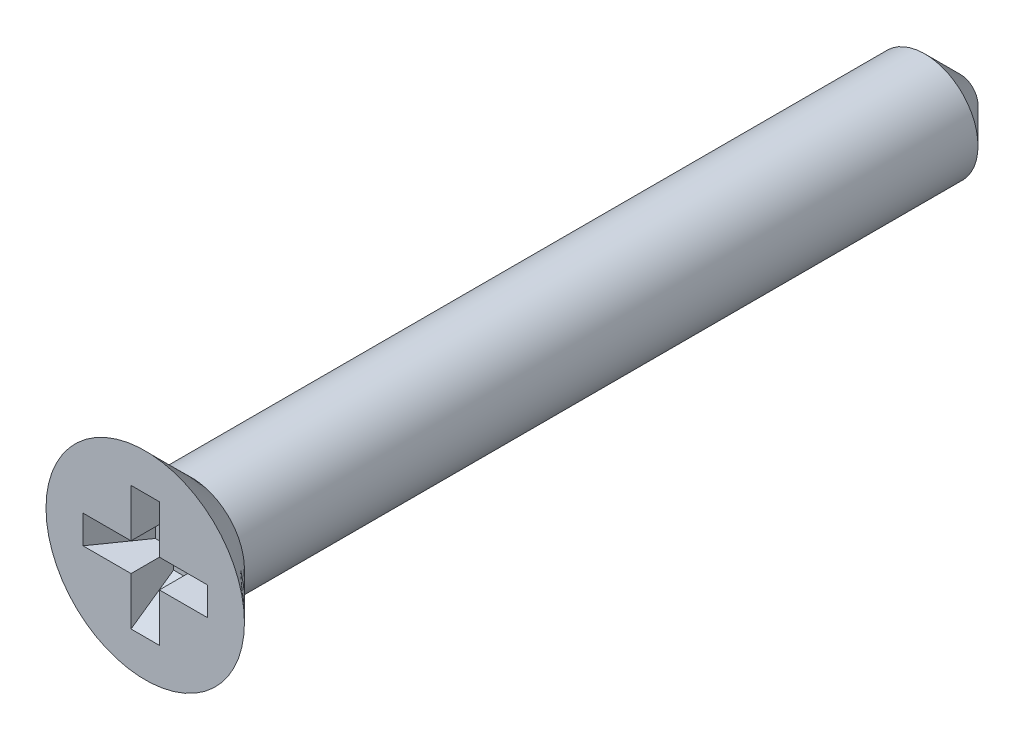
ISO-10303-21;
HEADER;
FILE_DESCRIPTION(('STEP AP214'),'2;1');
FILE_NAME('part.step','',(''),(''),'','','');
FILE_SCHEMA(('AUTOMOTIVE_DESIGN { 1 0 10303 214 1 1 1 1 }'));
ENDSEC;
DATA;
#1=APPLICATION_CONTEXT('core data for automotive mechanical design processes');
#2=APPLICATION_PROTOCOL_DEFINITION('international standard','automotive_design',2000,#1);
#3=PRODUCT_CONTEXT('',#1,'mechanical');
#4=PRODUCT('Part','Part','',(#3));
#5=PRODUCT_RELATED_PRODUCT_CATEGORY('part','',(#4));
#6=PRODUCT_DEFINITION_FORMATION('','',#4);
#7=PRODUCT_DEFINITION_CONTEXT('part definition',#1,'design');
#8=PRODUCT_DEFINITION('design','',#6,#7);
#9=PRODUCT_DEFINITION_SHAPE('','',#8);
#10=(LENGTH_UNIT() NAMED_UNIT(*) SI_UNIT(.MILLI.,.METRE.));
#11=(NAMED_UNIT(*) PLANE_ANGLE_UNIT() SI_UNIT($,.RADIAN.));
#12=(NAMED_UNIT(*) SI_UNIT($,.STERADIAN.) SOLID_ANGLE_UNIT());
#13=UNCERTAINTY_MEASURE_WITH_UNIT(LENGTH_MEASURE(1.E-05),#10,'distance_accuracy_value','');
#14=(GEOMETRIC_REPRESENTATION_CONTEXT(3) GLOBAL_UNCERTAINTY_ASSIGNED_CONTEXT((#13)) GLOBAL_UNIT_ASSIGNED_CONTEXT((#10,
#11,#12)) REPRESENTATION_CONTEXT('',''));
#15=CARTESIAN_POINT('',(0.,0.,0.));
#16=DIRECTION('',(0.,0.,1.));
#17=DIRECTION('',(1.,0.,0.));
#18=AXIS2_PLACEMENT_3D('',#15,#16,#17);
#19=CARTESIAN_POINT('',(-1.75499287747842,-0.4,0.));
#20=DIRECTION('',(0.819152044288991,0.,0.573576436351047));
#21=DIRECTION('',(0.573576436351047,0.,-0.819152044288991));
#22=AXIS2_PLACEMENT_3D('',#19,#20,#21);
#23=PLANE('',#22);
#24=DIRECTION('',(0.,1.,0.));
#25=VECTOR('',#24,1.);
#26=CARTESIAN_POINT('',(0.,0.4,-2.50638957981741));
#27=LINE('',#26,#25);
#28=CARTESIAN_POINT('',(0.,-0.29361042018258,-2.50638957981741));
#29=VERTEX_POINT('',#28);
#30=CARTESIAN_POINT('',(0.,0.,-2.50638957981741));
#31=VERTEX_POINT('',#30);
#32=EDGE_CURVE('E354',#29,#31,#27,.T.);
#33=ORIENTED_EDGE('',*,*,#32,.F.);
#34=CARTESIAN_POINT('',(0.103438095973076,-0.102874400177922,-2.65411449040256));
#35=CARTESIAN_POINT('',(0.09992365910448,-0.113485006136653,-2.64909535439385));
#36=CARTESIAN_POINT('',(0.096077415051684,-0.123726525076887,-2.64360234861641));
#37=CARTESIAN_POINT('',(0.0878958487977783,-0.143557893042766,-2.63191786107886));
#38=CARTESIAN_POINT('',(0.0835619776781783,-0.153149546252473,-2.62572845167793));
#39=CARTESIAN_POINT('',(0.0745900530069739,-0.171760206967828,-2.61291521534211));
#40=CARTESIAN_POINT('',(0.0699544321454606,-0.180782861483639,-2.60629486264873));
#41=CARTESIAN_POINT('',(0.0604348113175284,-0.198432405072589,-2.59269943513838));
#42=CARTESIAN_POINT('',(0.0555506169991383,-0.207058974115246,-2.58572408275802));
#43=CARTESIAN_POINT('',(0.0425194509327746,-0.229237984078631,-2.56711364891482));
#44=CARTESIAN_POINT('',(0.0342270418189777,-0.242528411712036,-2.55527086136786));
#45=CARTESIAN_POINT('',(0.0172728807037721,-0.268554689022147,-2.5310578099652));
#46=CARTESIAN_POINT('',(0.00860925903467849,-0.28128685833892,-2.51868487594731));
#47=CARTESIAN_POINT('',(-0.000140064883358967,-0.2938104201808,-2.50618954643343));
#48=B_SPLINE_CURVE_WITH_KNOTS('',3,(#34,#35,#36,#37,#38,#39,#40,#41,#42,#43,#44,#45,#46,#47),
.UNSPECIFIED.,.F.,.F.,(4,2,2,2,2,2,4),(0.,0.036695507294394,0.0732845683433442,
0.109608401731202,0.145961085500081,0.204852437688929,0.264086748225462),.UNSPECIFIED.);
#49=CARTESIAN_POINT('',(0.103298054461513,-0.103298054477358,-2.65391449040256));
#50=VERTEX_POINT('',#49);
#51=EDGE_CURVE('E289',#50,#29,#48,.T.);
#52=ORIENTED_EDGE('',*,*,#51,.F.);
#53=DIRECTION('',(-0.497542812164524,0.497542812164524,0.710564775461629));
#54=VECTOR('',#53,1.);
#55=CARTESIAN_POINT('',(-1.41956594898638,1.41956594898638,-0.479039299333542));
#56=LINE('',#55,#54);
#57=EDGE_CURVE('E352',#50,#31,#56,.T.);
#58=ORIENTED_EDGE('',*,*,#57,.T.);
#59=EDGE_LOOP('',(#33,#52,#58));
#60=FACE_BOUND('',#59,.T.);
#61=ADVANCED_FACE('F27',(#60),#23,.T.);
#62=DIRECTION('',(0.,1.,0.));
#63=VECTOR('',#62,1.);
#64=CARTESIAN_POINT('',(-0.91474383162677,-0.4,-1.2));
#65=LINE('',#64,#63);
#66=CARTESIAN_POINT('',(-0.91474383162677,0.4,-1.2));
#67=VERTEX_POINT('',#66);
#68=CARTESIAN_POINT('',(-0.91474383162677,-0.4,-1.2));
#69=VERTEX_POINT('',#68);
#70=EDGE_CURVE('E348',#67,#69,#65,.F.);
#71=ORIENTED_EDGE('',*,*,#70,.F.);
#72=DIRECTION('',(0.573576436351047,0.,-0.819152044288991));
#73=VECTOR('',#72,1.);
#74=CARTESIAN_POINT('',(-1.19117730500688,0.4,-0.8052120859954));
#75=LINE('',#74,#73);
#76=CARTESIAN_POINT('',(-1.75499287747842,0.4,0.));
#77=VERTEX_POINT('',#76);
#78=EDGE_CURVE('E232',#67,#77,#75,.F.);
#79=ORIENTED_EDGE('',*,*,#78,.T.);
#80=DIRECTION('',(0.,-1.,0.));
#81=VECTOR('',#80,1.);
#82=CARTESIAN_POINT('',(-1.75499287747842,-0.4,0.));
#83=LINE('',#82,#81);
#84=CARTESIAN_POINT('',(-1.75499287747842,-0.4,0.));
#85=VERTEX_POINT('',#84);
#86=EDGE_CURVE('E173',#77,#85,#83,.T.);
#87=ORIENTED_EDGE('',*,*,#86,.T.);
#88=DIRECTION('',(0.573576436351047,0.,-0.819152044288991));
#89=VECTOR('',#88,1.);
#90=CARTESIAN_POINT('',(-1.75499287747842,-0.4,0.));
#91=LINE('',#90,#89);
#92=EDGE_CURVE('E164',#69,#85,#91,.F.);
#93=ORIENTED_EDGE('',*,*,#92,.F.);
#94=EDGE_LOOP('',(#71,#79,#87,#93));
#95=FACE_BOUND('',#94,.T.);
#96=ADVANCED_FACE('F283',(#95),#23,.T.);
#97=CARTESIAN_POINT('',(0.4,-1.75499287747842,0.));
#98=DIRECTION('',(0.,0.819152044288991,0.573576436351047));
#99=DIRECTION('',(0.,-0.573576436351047,0.819152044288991));
#100=AXIS2_PLACEMENT_3D('',#97,#98,#99);
#101=PLANE('',#100);
#102=DIRECTION('',(-1.,0.,0.));
#103=VECTOR('',#102,1.);
#104=CARTESIAN_POINT('',(0.4,-0.91474383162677,-1.2));
#105=LINE('',#104,#103);
#106=CARTESIAN_POINT('',(-0.4,-0.91474383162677,-1.2));
#107=VERTEX_POINT('',#106);
#108=CARTESIAN_POINT('',(0.4,-0.91474383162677,-1.2));
#109=VERTEX_POINT('',#108);
#110=EDGE_CURVE('E346',#107,#109,#105,.F.);
#111=ORIENTED_EDGE('',*,*,#110,.F.);
#112=DIRECTION('',(0.,0.573576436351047,-0.819152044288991));
#113=VECTOR('',#112,1.);
#114=CARTESIAN_POINT('',(-0.4,-0.74539829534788,-1.44185049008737));
#115=LINE('',#114,#113);
#116=CARTESIAN_POINT('',(-0.4,-1.75499287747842,0.));
#117=VERTEX_POINT('',#116);
#118=EDGE_CURVE('E163',#107,#117,#115,.F.);
#119=ORIENTED_EDGE('',*,*,#118,.T.);
#120=DIRECTION('',(1.,0.,0.));
#121=VECTOR('',#120,1.);
#122=CARTESIAN_POINT('',(0.4,-1.75499287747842,0.));
#123=LINE('',#122,#121);
#124=CARTESIAN_POINT('',(0.4,-1.75499287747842,0.));
#125=VERTEX_POINT('',#124);
#126=EDGE_CURVE('E179',#117,#125,#123,.T.);
#127=ORIENTED_EDGE('',*,*,#126,.T.);
#128=DIRECTION('',(0.,0.573576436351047,-0.819152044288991));
#129=VECTOR('',#128,1.);
#130=CARTESIAN_POINT('',(0.4,-1.75499287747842,0.));
#131=LINE('',#130,#129);
#132=EDGE_CURVE('E240',#109,#125,#131,.F.);
#133=ORIENTED_EDGE('',*,*,#132,.F.);
#134=EDGE_LOOP('',(#111,#119,#127,#133));
#135=FACE_BOUND('',#134,.T.);
#136=ADVANCED_FACE('F279',(#135),#101,.T.);
#137=CARTESIAN_POINT('',(-1.75499287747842,1.75499287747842,-1.2));
#138=DIRECTION('',(0.,0.,-1.));
#139=DIRECTION('',(-1.,0.,0.));
#140=AXIS2_PLACEMENT_3D('',#137,#138,#139);
#141=PLANE('',#140);
#142=DIRECTION('',(0.,-1.,0.));
#143=VECTOR('',#142,1.);
#144=CARTESIAN_POINT('',(-0.4,1.75499287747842,-1.2));
#145=LINE('',#144,#143);
#146=CARTESIAN_POINT('',(-0.4,1.54919333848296,-1.2));
#147=VERTEX_POINT('',#146);
#148=CARTESIAN_POINT('',(-0.4,0.91474383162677,-1.2));
#149=VERTEX_POINT('',#148);
#150=EDGE_CURVE('E223',#147,#149,#145,.T.);
#151=ORIENTED_EDGE('',*,*,#150,.T.);
#152=CARTESIAN_POINT('',(-0.4,0.4,-1.2));
#153=VERTEX_POINT('',#152);
#154=EDGE_CURVE('E224',#149,#153,#145,.T.);
#155=ORIENTED_EDGE('',*,*,#154,.T.);
#156=DIRECTION('',(-1.,0.,0.));
#157=VECTOR('',#156,1.);
#158=CARTESIAN_POINT('',(-1.75499287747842,0.4,-1.2));
#159=LINE('',#158,#157);
#160=EDGE_CURVE('E227',#153,#67,#159,.T.);
#161=ORIENTED_EDGE('',*,*,#160,.T.);
#162=ORIENTED_EDGE('',*,*,#70,.T.);
#163=DIRECTION('',(1.,0.,0.));
#164=VECTOR('',#163,1.);
#165=CARTESIAN_POINT('',(-1.75499287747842,-0.4,-1.2));
#166=LINE('',#165,#164);
#167=CARTESIAN_POINT('',(-0.4,-0.4,-1.2));
#168=VERTEX_POINT('',#167);
#169=EDGE_CURVE('E208',#69,#168,#166,.T.);
#170=ORIENTED_EDGE('',*,*,#169,.T.);
#171=DIRECTION('',(0.,-1.,0.));
#172=VECTOR('',#171,1.);
#173=CARTESIAN_POINT('',(-0.4,-0.4,-1.2));
#174=LINE('',#173,#172);
#175=EDGE_CURVE('E159',#168,#107,#174,.T.);
#176=ORIENTED_EDGE('',*,*,#175,.T.);
#177=ORIENTED_EDGE('',*,*,#110,.T.);
#178=DIRECTION('',(0.,1.,0.));
#179=VECTOR('',#178,1.);
#180=CARTESIAN_POINT('',(0.4,-0.4,-1.2));
#181=LINE('',#180,#179);
#182=CARTESIAN_POINT('',(0.4,-0.4,-1.2));
#183=VERTEX_POINT('',#182);
#184=EDGE_CURVE('E211',#109,#183,#181,.T.);
#185=ORIENTED_EDGE('',*,*,#184,.T.);
#186=DIRECTION('',(1.,0.,0.));
#187=VECTOR('',#186,1.);
#188=CARTESIAN_POINT('',(0.4,-0.4,-1.2));
#189=LINE('',#188,#187);
#190=CARTESIAN_POINT('',(0.91474383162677,-0.4,-1.2));
#191=VERTEX_POINT('',#190);
#192=EDGE_CURVE('E214',#183,#191,#189,.T.);
#193=ORIENTED_EDGE('',*,*,#192,.T.);
#194=DIRECTION('',(0.,-1.,0.));
#195=VECTOR('',#194,1.);
#196=CARTESIAN_POINT('',(0.91474383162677,0.4,-1.2));
#197=LINE('',#196,#195);
#198=CARTESIAN_POINT('',(0.91474383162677,0.4,-1.2));
#199=VERTEX_POINT('',#198);
#200=EDGE_CURVE('E339',#191,#199,#197,.F.);
#201=ORIENTED_EDGE('',*,*,#200,.T.);
#202=DIRECTION('',(-1.,0.,0.));
#203=VECTOR('',#202,1.);
#204=CARTESIAN_POINT('',(0.4,0.4,-1.2));
#205=LINE('',#204,#203);
#206=CARTESIAN_POINT('',(0.4,0.4,-1.2));
#207=VERTEX_POINT('',#206);
#208=EDGE_CURVE('E217',#199,#207,#205,.T.);
#209=ORIENTED_EDGE('',*,*,#208,.T.);
#210=DIRECTION('',(0.,1.,0.));
#211=VECTOR('',#210,1.);
#212=CARTESIAN_POINT('',(0.4,1.75499287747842,-1.2));
#213=LINE('',#212,#211);
#214=CARTESIAN_POINT('',(0.4,0.91474383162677,-1.2));
#215=VERTEX_POINT('',#214);
#216=EDGE_CURVE('E220',#207,#215,#213,.T.);
#217=ORIENTED_EDGE('',*,*,#216,.T.);
#218=CARTESIAN_POINT('',(0.4,1.54919333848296,-1.2));
#219=VERTEX_POINT('',#218);
#220=EDGE_CURVE('E221',#215,#219,#213,.T.);
#221=ORIENTED_EDGE('',*,*,#220,.T.);
#222=CARTESIAN_POINT('',(0.,0.,-1.2));
#223=DIRECTION('',(0.,0.,-1.));
#224=DIRECTION('',(-1.,0.,0.));
#225=AXIS2_PLACEMENT_3D('',#222,#223,#224);
#226=CIRCLE('',#225,1.6);
#227=EDGE_CURVE('E249',#147,#219,#226,.T.);
#228=ORIENTED_EDGE('',*,*,#227,.F.);
#229=EDGE_LOOP('',(#151,#155,#161,#162,#170,#176,#177,#185,#193,#201,#209,#217,#221,#228));
#230=FACE_BOUND('',#229,.T.);
#231=ADVANCED_FACE('F282',(#230),#141,.F.);
#232=CARTESIAN_POINT('',(1.75499287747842,0.4,0.));
#233=DIRECTION('',(-0.819152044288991,0.,0.573576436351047));
#234=DIRECTION('',(0.573576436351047,0.,0.819152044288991));
#235=AXIS2_PLACEMENT_3D('',#232,#233,#234);
#236=PLANE('',#235);
#237=ORIENTED_EDGE('',*,*,#200,.F.);
#238=DIRECTION('',(-0.573576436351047,0.,-0.819152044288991));
#239=VECTOR('',#238,1.);
#240=CARTESIAN_POINT('',(0.74539829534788,-0.4,-1.44185049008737));
#241=LINE('',#240,#239);
#242=CARTESIAN_POINT('',(1.75499287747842,-0.4,0.));
#243=VERTEX_POINT('',#242);
#244=EDGE_CURVE('E239',#191,#243,#241,.F.);
#245=ORIENTED_EDGE('',*,*,#244,.T.);
#246=DIRECTION('',(0.,1.,0.));
#247=VECTOR('',#246,1.);
#248=CARTESIAN_POINT('',(1.75499287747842,0.4,0.));
#249=LINE('',#248,#247);
#250=CARTESIAN_POINT('',(1.75499287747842,0.4,0.));
#251=VERTEX_POINT('',#250);
#252=EDGE_CURVE('E190',#243,#251,#249,.T.);
#253=ORIENTED_EDGE('',*,*,#252,.T.);
#254=DIRECTION('',(-0.573576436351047,0.,-0.819152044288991));
#255=VECTOR('',#254,1.);
#256=CARTESIAN_POINT('',(1.75499287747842,0.4,0.));
#257=LINE('',#256,#255);
#258=EDGE_CURVE('E237',#199,#251,#257,.F.);
#259=ORIENTED_EDGE('',*,*,#258,.F.);
#260=EDGE_LOOP('',(#237,#245,#253,#259));
#261=FACE_BOUND('',#260,.T.);
#262=ADVANCED_FACE('F318',(#261),#236,.T.);
#263=CARTESIAN_POINT('',(-0.4,1.75499287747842,-1.2));
#264=DIRECTION('',(-1.,0.,0.));
#265=DIRECTION('',(0.,-1.,0.));
#266=AXIS2_PLACEMENT_3D('',#263,#264,#265);
#267=PLANE('',#266);
#268=DIRECTION('',(0.,-0.573576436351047,-0.819152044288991));
#269=VECTOR('',#268,1.);
#270=CARTESIAN_POINT('',(-0.4,1.75499287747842,0.));
#271=LINE('',#270,#269);
#272=CARTESIAN_POINT('',(-0.399999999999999,0.0800481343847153,-2.39206899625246));
#273=VERTEX_POINT('',#272);
#274=EDGE_CURVE('E233',#273,#149,#271,.F.);
#275=ORIENTED_EDGE('',*,*,#274,.T.);
#276=ORIENTED_EDGE('',*,*,#150,.F.);
#277=CARTESIAN_POINT('',(-0.399999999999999,15.0579581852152,12.2632700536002));
#278=CARTESIAN_POINT('',(-0.399999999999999,14.5558054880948,11.7612956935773));
#279=CARTESIAN_POINT('',(-0.399999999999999,14.0536451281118,11.2593289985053));
#280=CARTESIAN_POINT('',(-0.399999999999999,13.0492997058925,10.2554201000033));
#281=CARTESIAN_POINT('',(-0.399999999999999,12.5471146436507,9.75347789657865));
#282=CARTESIAN_POINT('',(-0.4,11.5427035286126,8.74962023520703));
#283=CARTESIAN_POINT('',(-0.4,11.0404774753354,8.24770477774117));
#284=CARTESIAN_POINT('',(-0.4,10.035974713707,7.24392476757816));
#285=CARTESIAN_POINT('',(-0.4,9.53369800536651,6.74206021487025));
#286=CARTESIAN_POINT('',(-0.4,8.53379190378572,5.74313239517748));
#287=CARTESIAN_POINT('',(-0.4,8.03616325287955,5.24606838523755));
#288=CARTESIAN_POINT('',(-0.4,7.04077073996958,4.25207516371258));
#289=CARTESIAN_POINT('',(-0.4,6.54300687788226,3.75514595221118));
#290=CARTESIAN_POINT('',(-0.4,5.54723950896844,2.76153914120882));
#291=CARTESIAN_POINT('',(-0.4,5.04923600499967,2.26486153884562));
#292=CARTESIAN_POINT('',(-0.4,4.30178667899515,1.52029138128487));
#293=CARTESIAN_POINT('',(-0.4,4.05256301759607,1.27217582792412));
#294=CARTESIAN_POINT('',(-0.4,3.55386033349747,0.776201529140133));
#295=CARTESIAN_POINT('',(-0.4,3.30438131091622,0.528342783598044));
#296=CARTESIAN_POINT('',(-0.4,2.93753545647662,0.164606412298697));
#297=CARTESIAN_POINT('',(-0.4,2.82036145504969,0.0485343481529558));
#298=CARTESIAN_POINT('',(-0.4,2.58585174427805,-0.183450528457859));
#299=CARTESIAN_POINT('',(-0.4,2.46851603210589,-0.299363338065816));
#300=CARTESIAN_POINT('',(-0.4,2.23338081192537,-0.531167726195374));
#301=CARTESIAN_POINT('',(-0.4,2.11558084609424,-0.647058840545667));
#302=CARTESIAN_POINT('',(-0.4,1.8796050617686,-0.878446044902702));
#303=CARTESIAN_POINT('',(-0.4,1.76142926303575,-0.993942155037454));
#304=CARTESIAN_POINT('',(-0.4,1.56017330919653,-1.18948487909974));
#305=CARTESIAN_POINT('',(-0.4,1.47726626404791,-1.26970931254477));
#306=CARTESIAN_POINT('',(-0.4,1.3109062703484,-1.42961730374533));
#307=CARTESIAN_POINT('',(-0.4,1.22745323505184,-1.5093007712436));
#308=CARTESIAN_POINT('',(-0.4,1.05990662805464,-1.66747507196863));
#309=CARTESIAN_POINT('',(-0.4,0.975815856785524,-1.74596884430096));
#310=CARTESIAN_POINT('',(-0.4,0.848350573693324,-1.8622334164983));
#311=CARTESIAN_POINT('',(-0.4,0.805646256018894,-1.9007373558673));
#312=CARTESIAN_POINT('',(-0.4,0.719561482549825,-1.97697966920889));
#313=CARTESIAN_POINT('',(-0.4,0.676181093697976,-2.01471811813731));
#314=CARTESIAN_POINT('',(-0.4,0.592876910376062,-2.08511456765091));
#315=CARTESIAN_POINT('',(-0.4,0.553057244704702,-2.11789551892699));
#316=CARTESIAN_POINT('',(-0.4,0.471811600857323,-2.18196758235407));
#317=CARTESIAN_POINT('',(-0.4,0.430377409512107,-2.21324856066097));
#318=CARTESIAN_POINT('',(-0.4,0.366190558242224,-2.25791062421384));
#319=CARTESIAN_POINT('',(-0.4,0.344296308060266,-2.27251479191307));
#320=CARTESIAN_POINT('',(-0.4,0.299692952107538,-2.30048853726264));
#321=CARTESIAN_POINT('',(-0.4,0.276983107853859,-2.31385695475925));
#322=CARTESIAN_POINT('',(-0.4,0.230746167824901,-2.33862577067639));
#323=CARTESIAN_POINT('',(-0.4,0.207227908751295,-2.35004229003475));
#324=CARTESIAN_POINT('',(-0.4,0.159057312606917,-2.37009132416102));
#325=CARTESIAN_POINT('',(-0.4,0.134407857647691,-2.37873050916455));
#326=CARTESIAN_POINT('',(-0.4,0.0836001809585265,-2.3920966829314));
#327=CARTESIAN_POINT('',(-0.4,0.0574247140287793,-2.39676217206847));
#328=CARTESIAN_POINT('',(-0.4,0.0047203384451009,-2.4008277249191));
#329=CARTESIAN_POINT('',(-0.4,-0.0218072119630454,-2.40024417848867));
#330=CARTESIAN_POINT('',(-0.4,-0.0740664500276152,-2.394031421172));
#331=CARTESIAN_POINT('',(-0.4,-0.0998019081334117,-2.38843198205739));
#332=CARTESIAN_POINT('',(-0.4,-0.137559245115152,-2.37718134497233));
#333=CARTESIAN_POINT('',(-0.4,-0.150037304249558,-2.37294020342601));
#334=CARTESIAN_POINT('',(-0.4,-0.174694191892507,-2.36366501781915));
#335=CARTESIAN_POINT('',(-0.4,-0.186873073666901,-2.35863111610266));
#336=CARTESIAN_POINT('',(-0.4,-0.221460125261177,-2.34323447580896));
#337=CARTESIAN_POINT('',(-0.4,-0.243504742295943,-2.33205986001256));
#338=CARTESIAN_POINT('',(-0.4,-0.28674808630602,-2.30816513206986));
#339=CARTESIAN_POINT('',(-0.4,-0.307945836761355,-2.2954433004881));
#340=CARTESIAN_POINT('',(-0.4,-0.370676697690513,-2.25562796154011));
#341=CARTESIAN_POINT('',(-0.4,-0.411199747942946,-2.22695881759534));
#342=CARTESIAN_POINT('',(-0.4,-0.491046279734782,-2.16720199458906));
#343=CARTESIAN_POINT('',(-0.4,-0.530352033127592,-2.13609149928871));
#344=CARTESIAN_POINT('',(-0.4,-0.607844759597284,-2.07268891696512));
#345=CARTESIAN_POINT('',(-0.4,-0.646034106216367,-2.04039972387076));
#346=CARTESIAN_POINT('',(-0.4,-0.720929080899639,-1.97574798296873));
#347=CARTESIAN_POINT('',(-0.4,-0.757648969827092,-1.94340180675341));
#348=CARTESIAN_POINT('',(-0.4,-0.830642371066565,-1.8782086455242));
#349=CARTESIAN_POINT('',(-0.4,-0.866915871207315,-1.84536164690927));
#350=CARTESIAN_POINT('',(-0.4,-0.97527461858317,-1.74629556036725));
#351=CARTESIAN_POINT('',(-0.4,-1.04688735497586,-1.67956084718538));
#352=CARTESIAN_POINT('',(-0.4,-1.1894988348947,-1.54527111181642));
#353=CARTESIAN_POINT('',(-0.4,-1.26049672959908,-1.47771519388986));
#354=CARTESIAN_POINT('',(-0.4,-1.40204788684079,-1.34215102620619));
#355=CARTESIAN_POINT('',(-0.4,-1.47260118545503,-1.27414281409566));
#356=CARTESIAN_POINT('',(-0.4,-1.61263010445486,-1.1385931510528));
#357=CARTESIAN_POINT('',(-0.4,-1.68210893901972,-1.07105501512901));
#358=CARTESIAN_POINT('',(-0.4,-1.82087103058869,-0.935775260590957));
#359=CARTESIAN_POINT('',(-0.4,-1.89015428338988,-0.868033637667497));
#360=CARTESIAN_POINT('',(-0.4,-2.09772182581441,-0.664662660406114));
#361=CARTESIAN_POINT('',(-0.4,-2.23579508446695,-0.528818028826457));
#362=CARTESIAN_POINT('',(-0.4,-2.64691525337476,-0.123422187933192));
#363=CARTESIAN_POINT('',(-0.4,-2.9195143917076,0.146582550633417));
#364=CARTESIAN_POINT('',(-0.4,-3.46422315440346,0.687087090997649));
#365=CARTESIAN_POINT('',(-0.4,-3.73633277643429,0.957586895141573));
#366=CARTESIAN_POINT('',(-0.4,-4.28035165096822,1.4989153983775));
#367=CARTESIAN_POINT('',(-0.4,-4.55226084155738,1.76974415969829));
#368=CARTESIAN_POINT('',(-0.4,-5.09592685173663,2.31155357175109));
#369=CARTESIAN_POINT('',(-0.4,-5.3676836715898,2.58253422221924));
#370=CARTESIAN_POINT('',(-0.4,-6.19795427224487,3.41071951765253));
#371=CARTESIAN_POINT('',(-0.4,-6.75631703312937,3.96807555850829));
#372=CARTESIAN_POINT('',(-0.4,-7.59365945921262,4.80417361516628));
#373=CARTESIAN_POINT('',(-0.4,-7.87270550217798,5.08284918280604));
#374=CARTESIAN_POINT('',(-0.4,-8.43076267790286,5.64023492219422));
#375=CARTESIAN_POINT('',(-0.4,-8.70977381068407,5.91894509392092));
#376=CARTESIAN_POINT('',(-0.4,-8.98877231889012,6.19766790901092));
#377=B_SPLINE_CURVE_WITH_KNOTS('',3,(#277,#278,#279,#280,#281,#282,#283,#284,#285,#286,#287,
#288,#289,#290,#291,#292,#293,#294,#295,#296,#297,#298,#299,#300,#301,#302,#303,#304,#305,#306,
#307,#308,#309,#310,#311,#312,#313,#314,#315,#316,#317,#318,#319,#320,#321,#322,#323,#324,#325,
#326,#327,#328,#329,#330,#331,#332,#333,#334,#335,#336,#337,#338,#339,#340,#341,#342,#343,#344,
#345,#346,#347,#348,#349,#350,#351,#352,#353,#354,#355,#356,#357,#358,#359,#360,#361,#362,#363,
#364,#365,#366,#367,#368,#369,#370,#371,#372,#373,#374,#375,#376),.UNSPECIFIED.,.F.,.F.,(4,2,2,
2,2,2,2,2,2,2,2,2,2,2,2,2,2,2,2,2,2,2,2,2,2,2,2,2,2,2,2,2,2,2,2,2,2,2,2,2,2,2,2,2,2,2,2,2,2,4),
(0.,2.13007518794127,4.26015084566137,6.39025675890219,8.5203622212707,10.630424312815,
12.7404877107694,14.8505265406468,15.905544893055,16.9605627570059,17.4553578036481,
17.9501616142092,18.4459113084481,18.9416353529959,19.2877342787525,19.6338895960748,
19.9789680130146,20.1514624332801,20.3239398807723,20.4786541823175,20.6342979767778,
20.7132243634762,20.7922241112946,20.8705360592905,20.9486584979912,21.0279691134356,
21.1070321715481,21.1856290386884,21.2251461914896,21.2646562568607,21.3387009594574,
21.412828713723,21.5615772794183,21.7119356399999,21.8619468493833,22.0087463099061,
22.1555497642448,22.4491996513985,22.7432052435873,23.0371866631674,23.3278722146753,
23.6185639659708,24.1996497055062,25.3506976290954,26.5017510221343,27.6530742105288,
28.8043954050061,31.1711932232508,32.3542996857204,33.5374054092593),.UNSPECIFIED.);
#378=CARTESIAN_POINT('',(-0.4,1.4456832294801,-1.3));
#379=VERTEX_POINT('',#378);
#380=EDGE_CURVE('E266',#379,#147,#377,.F.);
#381=ORIENTED_EDGE('',*,*,#380,.F.);
#382=EDGE_CURVE('E333',#273,#379,#377,.F.);
#383=ORIENTED_EDGE('',*,*,#382,.F.);
#384=EDGE_LOOP('',(#275,#276,#381,#383));
#385=FACE_BOUND('',#384,.T.);
#386=ADVANCED_FACE('F329',(#385),#267,.T.);
#387=CARTESIAN_POINT('',(0.4,1.75499287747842,-1.2));
#388=DIRECTION('',(1.,0.,0.));
#389=DIRECTION('',(0.,0.,-1.));
#390=AXIS2_PLACEMENT_3D('',#387,#388,#389);
#391=PLANE('',#390);
#392=ORIENTED_EDGE('',*,*,#220,.F.);
#393=DIRECTION('',(0.,-0.573576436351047,-0.819152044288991));
#394=VECTOR('',#393,1.);
#395=CARTESIAN_POINT('',(0.4,1.19117730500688,-0.8052120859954));
#396=LINE('',#395,#394);
#397=CARTESIAN_POINT('',(0.4,0.080048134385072,-2.39206899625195));
#398=VERTEX_POINT('',#397);
#399=EDGE_CURVE('E236',#398,#215,#396,.F.);
#400=ORIENTED_EDGE('',*,*,#399,.F.);
#401=CARTESIAN_POINT('',(0.4,-8.98877231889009,6.19766790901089));
#402=CARTESIAN_POINT('',(0.4,-8.67677785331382,5.88598452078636));
#403=CARTESIAN_POINT('',(0.4,-8.36476980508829,5.57431472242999));
#404=CARTESIAN_POINT('',(0.4,-7.74070720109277,4.95101906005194));
#405=CARTESIAN_POINT('',(0.4,-7.42865264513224,4.63939319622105));
#406=CARTESIAN_POINT('',(0.4,-6.80445030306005,4.01617482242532));
#407=CARTESIAN_POINT('',(0.4,-6.49230251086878,3.70458231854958));
#408=CARTESIAN_POINT('',(0.4,-5.86791216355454,3.08149481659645));
#409=CARTESIAN_POINT('',(0.4,-5.55566960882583,2.76999981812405));
#410=CARTESIAN_POINT('',(0.4,-4.93358205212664,2.14971502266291));
#411=CARTESIAN_POINT('',(0.4,-4.6237383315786,1.84092394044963));
#412=CARTESIAN_POINT('',(0.4,-4.00378028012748,1.22360590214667));
#413=CARTESIAN_POINT('',(0.4,-3.69366594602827,0.915078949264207));
#414=CARTESIAN_POINT('',(0.4,-3.2280826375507,0.452721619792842));
#415=CARTESIAN_POINT('',(0.4,-3.07282418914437,0.298679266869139));
#416=CARTESIAN_POINT('',(0.4,-2.76208514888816,-0.00918294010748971));
#417=CARTESIAN_POINT('',(0.4,-2.60660455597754,-0.163002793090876));
#418=CARTESIAN_POINT('',(0.4,-2.2952766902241,-0.47026389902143));
#419=CARTESIAN_POINT('',(0.4,-2.13942942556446,-0.623705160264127));
#420=CARTESIAN_POINT('',(0.4,-1.82707739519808,-0.929916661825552));
#421=CARTESIAN_POINT('',(0.4,-1.67057263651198,-1.08268690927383));
#422=CARTESIAN_POINT('',(0.4,-1.4712876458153,-1.27534266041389));
#423=CARTESIAN_POINT('',(0.4,-1.42919052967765,-1.31593419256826));
#424=CARTESIAN_POINT('',(0.4,-1.34485413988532,-1.39696971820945));
#425=CARTESIAN_POINT('',(0.4,-1.30261486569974,-1.43741371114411));
#426=CARTESIAN_POINT('',(0.4,-1.21790078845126,-1.51815834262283));
#427=CARTESIAN_POINT('',(0.4,-1.17542576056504,-1.5584587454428));
#428=CARTESIAN_POINT('',(0.4,-1.09022739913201,-1.63879610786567));
#429=CARTESIAN_POINT('',(0.4,-1.04750406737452,-1.67883306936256));
#430=CARTESIAN_POINT('',(0.4,-0.946477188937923,-1.77269586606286));
#431=CARTESIAN_POINT('',(0.4,-0.888030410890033,-1.82636758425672));
#432=CARTESIAN_POINT('',(0.4,-0.770250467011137,-1.93246551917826));
#433=CARTESIAN_POINT('',(0.4,-0.710919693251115,-1.98489435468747));
#434=CARTESIAN_POINT('',(0.4,-0.609163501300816,-2.07156587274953));
#435=CARTESIAN_POINT('',(0.4,-0.567230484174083,-2.10638522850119));
#436=CARTESIAN_POINT('',(0.4,-0.481616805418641,-2.17449372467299));
#437=CARTESIAN_POINT('',(0.4,-0.437925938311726,-2.20777040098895));
#438=CARTESIAN_POINT('',(0.4,-0.370106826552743,-2.25527989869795));
#439=CARTESIAN_POINT('',(0.4,-0.346914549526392,-2.2708361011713));
#440=CARTESIAN_POINT('',(0.4,-0.299611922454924,-2.30057434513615));
#441=CARTESIAN_POINT('',(0.4,-0.275500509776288,-2.31475472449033));
#442=CARTESIAN_POINT('',(0.4,-0.226415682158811,-2.34083021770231));
#443=CARTESIAN_POINT('',(0.4,-0.201456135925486,-2.35275078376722));
#444=CARTESIAN_POINT('',(0.4,-0.150247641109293,-2.37335246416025));
#445=CARTESIAN_POINT('',(0.4,-0.124002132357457,-2.3820417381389));
#446=CARTESIAN_POINT('',(0.4,-0.0712736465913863,-2.39447099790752));
#447=CARTESIAN_POINT('',(0.4,-0.0448320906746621,-2.39837555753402));
#448=CARTESIAN_POINT('',(0.4,0.00826983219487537,-2.40078938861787));
#449=CARTESIAN_POINT('',(0.4,0.0349297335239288,-2.39930811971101));
#450=CARTESIAN_POINT('',(0.4,0.0872151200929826,-2.39142094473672));
#451=CARTESIAN_POINT('',(0.4,0.112847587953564,-2.38505800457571));
#452=CARTESIAN_POINT('',(0.4,0.162996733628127,-2.36872094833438));
#453=CARTESIAN_POINT('',(0.4,0.187507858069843,-2.35873067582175));
#454=CARTESIAN_POINT('',(0.4,0.250211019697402,-2.32944881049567));
#455=CARTESIAN_POINT('',(0.4,0.287474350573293,-2.30822859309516));
#456=CARTESIAN_POINT('',(0.4,0.36001468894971,-2.26257652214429));
#457=CARTESIAN_POINT('',(0.4,0.395285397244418,-2.23813521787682));
#458=CARTESIAN_POINT('',(0.4,0.464698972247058,-2.18731247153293));
#459=CARTESIAN_POINT('',(0.4,0.498834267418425,-2.16092076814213));
#460=CARTESIAN_POINT('',(0.4,0.566167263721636,-2.10707763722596));
#461=CARTESIAN_POINT('',(0.4,0.599366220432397,-2.07962775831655));
#462=CARTESIAN_POINT('',(0.4,0.688211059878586,-2.00455725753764));
#463=CARTESIAN_POINT('',(0.4,0.743294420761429,-1.95627354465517));
#464=CARTESIAN_POINT('',(0.4,0.852521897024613,-1.85861308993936));
#465=CARTESIAN_POINT('',(0.4,0.906665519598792,-1.80923580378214));
#466=CARTESIAN_POINT('',(0.4,1.0141200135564,-1.71003906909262));
#467=CARTESIAN_POINT('',(0.4,1.06743344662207,-1.66022239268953));
#468=CARTESIAN_POINT('',(0.4,1.17366653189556,-1.56017068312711));
#469=CARTESIAN_POINT('',(0.4,1.22658617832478,-1.50993564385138));
#470=CARTESIAN_POINT('',(0.4,1.34022302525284,-1.40147670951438));
#471=CARTESIAN_POINT('',(0.4,1.40089527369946,-1.34320575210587));
#472=CARTESIAN_POINT('',(0.4,1.52204643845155,-1.22635067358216));
#473=CARTESIAN_POINT('',(0.4,1.58252512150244,-1.16776631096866));
#474=CARTESIAN_POINT('',(0.4,1.76134257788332,-0.994028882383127));
#475=CARTESIAN_POINT('',(0.4,1.87943072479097,-0.878617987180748));
#476=CARTESIAN_POINT('',(0.4,2.11522557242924,-0.647406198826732));
#477=CARTESIAN_POINT('',(0.4,2.2329322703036,-0.531605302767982));
#478=CARTESIAN_POINT('',(0.4,2.58561472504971,-0.18393263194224));
#479=CARTESIAN_POINT('',(0.4,2.82024009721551,0.0482944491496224));
#480=CARTESIAN_POINT('',(0.4,3.26821543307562,0.492493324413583));
#481=CARTESIAN_POINT('',(0.4,3.48160116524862,0.704429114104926));
#482=CARTESIAN_POINT('',(0.4,3.90816301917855,1.12851207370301));
#483=CARTESIAN_POINT('',(0.4,4.12133914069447,1.34065924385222));
#484=CARTESIAN_POINT('',(0.4,4.76075243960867,1.97736484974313));
#485=CARTESIAN_POINT('',(0.4,5.18680015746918,2.40211347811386));
#486=CARTESIAN_POINT('',(0.4,6.40063874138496,3.61287974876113));
#487=CARTESIAN_POINT('',(0.4,7.18816227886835,4.39916530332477));
#488=CARTESIAN_POINT('',(0.4,8.76295040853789,5.97199608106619));
#489=CARTESIAN_POINT('',(0.4,9.55021500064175,6.75854130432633));
#490=CARTESIAN_POINT('',(0.4,11.1242654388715,8.33141136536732));
#491=CARTESIAN_POINT('',(0.4,11.9110513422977,9.1177361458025));
#492=CARTESIAN_POINT('',(0.4,13.4845477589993,10.6904604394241));
#493=CARTESIAN_POINT('',(0.4,14.2712582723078,11.4768599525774));
#494=CARTESIAN_POINT('',(0.4,15.0579581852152,12.2632700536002));
#495=B_SPLINE_CURVE_WITH_KNOTS('',3,(#401,#402,#403,#404,#405,#406,#407,#408,#409,#410,#411,
#412,#413,#414,#415,#416,#417,#418,#419,#420,#421,#422,#423,#424,#425,#426,#427,#428,#429,#430,
#431,#432,#433,#434,#435,#436,#437,#438,#439,#440,#441,#442,#443,#444,#445,#446,#447,#448,#449,
#450,#451,#452,#453,#454,#455,#456,#457,#458,#459,#460,#461,#462,#463,#464,#465,#466,#467,#468,
#469,#470,#471,#472,#473,#474,#475,#476,#477,#478,#479,#480,#481,#482,#483,#484,#485,#486,#487,
#488,#489,#490,#491,#492,#493,#494),.UNSPECIFIED.,.F.,.F.,(4,2,2,2,2,2,2,2,2,2,2,2,2,2,2,2,2,2,
2,2,2,2,2,2,2,2,2,2,2,2,2,2,2,2,2,2,2,2,2,2,2,2,2,2,2,2,4),(0.,1.3230206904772,2.64604695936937,
3.96920045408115,5.29234851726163,6.60467298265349,7.91701316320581,8.57314423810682,
9.22927845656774,9.88539816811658,10.5415108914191,10.7169488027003,10.8923873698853,
11.0680404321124,11.2436922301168,11.4817424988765,11.7192361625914,11.8827337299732,
12.0473795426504,12.1311266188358,12.2149736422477,12.2978114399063,12.3804386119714,
12.4601358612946,12.5396931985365,12.6185582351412,12.6977789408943,12.8260633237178,
12.9547328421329,13.0841355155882,13.2133555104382,13.4330718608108,13.6529001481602,
13.8717938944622,14.0906908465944,14.3430576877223,14.5956600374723,15.091016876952,
15.5863774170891,16.5767323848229,17.4789808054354,18.3812302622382,20.1860437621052,
23.5245978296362,26.8631529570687,30.2002247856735,33.5372951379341),.UNSPECIFIED.);
#496=CARTESIAN_POINT('',(0.4,1.4456832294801,-1.3));
#497=VERTEX_POINT('',#496);
#498=EDGE_CURVE('E252',#497,#398,#495,.F.);
#499=ORIENTED_EDGE('',*,*,#498,.F.);
#500=EDGE_CURVE('E340',#219,#497,#495,.F.);
#501=ORIENTED_EDGE('',*,*,#500,.F.);
#502=EDGE_LOOP('',(#392,#400,#499,#501));
#503=FACE_BOUND('',#502,.T.);
#504=ADVANCED_FACE('F378',(#503),#391,.T.);
#505=CARTESIAN_POINT('',(0.,0.,-1.3));
#506=DIRECTION('',(0.,0.,1.));
#507=DIRECTION('',(1.,0.,0.));
#508=AXIS2_PLACEMENT_3D('',#505,#506,#507);
#509=CONICAL_SURFACE('',#508,1.5,0.78539816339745);
#510=CARTESIAN_POINT('',(0.,0.,-1.3));
#511=DIRECTION('',(0.,0.,1.));
#512=DIRECTION('',(1.,0.,0.));
#513=AXIS2_PLACEMENT_3D('',#510,#511,#512);
#514=CIRCLE('',#513,1.5);
#515=EDGE_CURVE('E242',#497,#379,#514,.T.);
#516=ORIENTED_EDGE('',*,*,#515,.T.);
#517=ORIENTED_EDGE('',*,*,#380,.T.);
#518=ORIENTED_EDGE('',*,*,#227,.T.);
#519=ORIENTED_EDGE('',*,*,#500,.T.);
#520=EDGE_LOOP('',(#516,#517,#518,#519));
#521=FACE_BOUND('',#520,.T.);
#522=ADVANCED_FACE('F427',(#521),#509,.T.);
#523=CARTESIAN_POINT('',(0.,2.8,0.));
#524=DIRECTION('',(0.,0.,-1.));
#525=DIRECTION('',(-1.,0.,0.));
#526=AXIS2_PLACEMENT_3D('',#523,#524,#525);
#527=PLANE('',#526);
#528=DIRECTION('',(1.,0.,0.));
#529=VECTOR('',#528,1.);
#530=CARTESIAN_POINT('',(-1.75499287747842,-0.4,0.));
#531=LINE('',#530,#529);
#532=CARTESIAN_POINT('',(-0.4,-0.4,0.));
#533=VERTEX_POINT('',#532);
#534=EDGE_CURVE('E167',#85,#533,#531,.T.);
#535=ORIENTED_EDGE('',*,*,#534,.F.);
#536=ORIENTED_EDGE('',*,*,#86,.F.);
#537=DIRECTION('',(-1.,0.,0.));
#538=VECTOR('',#537,1.);
#539=CARTESIAN_POINT('',(-1.75499287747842,0.4,0.));
#540=LINE('',#539,#538);
#541=CARTESIAN_POINT('',(-0.4,0.4,0.));
#542=VERTEX_POINT('',#541);
#543=EDGE_CURVE('E205',#542,#77,#540,.T.);
#544=ORIENTED_EDGE('',*,*,#543,.F.);
#545=DIRECTION('',(0.,-1.,0.));
#546=VECTOR('',#545,1.);
#547=CARTESIAN_POINT('',(-0.4,1.75499287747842,0.));
#548=LINE('',#547,#546);
#549=CARTESIAN_POINT('',(-0.4,1.75499287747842,0.));
#550=VERTEX_POINT('',#549);
#551=EDGE_CURVE('E202',#550,#542,#548,.T.);
#552=ORIENTED_EDGE('',*,*,#551,.F.);
#553=DIRECTION('',(-1.,0.,0.));
#554=VECTOR('',#553,1.);
#555=CARTESIAN_POINT('',(-0.4,1.75499287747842,0.));
#556=LINE('',#555,#554);
#557=CARTESIAN_POINT('',(0.4,1.75499287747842,0.));
#558=VERTEX_POINT('',#557);
#559=EDGE_CURVE('E199',#558,#550,#556,.T.);
#560=ORIENTED_EDGE('',*,*,#559,.F.);
#561=DIRECTION('',(0.,1.,0.));
#562=VECTOR('',#561,1.);
#563=CARTESIAN_POINT('',(0.4,1.75499287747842,0.));
#564=LINE('',#563,#562);
#565=CARTESIAN_POINT('',(0.4,0.4,0.));
#566=VERTEX_POINT('',#565);
#567=EDGE_CURVE('E196',#566,#558,#564,.T.);
#568=ORIENTED_EDGE('',*,*,#567,.F.);
#569=DIRECTION('',(-1.,0.,0.));
#570=VECTOR('',#569,1.);
#571=CARTESIAN_POINT('',(0.4,0.4,0.));
#572=LINE('',#571,#570);
#573=EDGE_CURVE('E193',#251,#566,#572,.T.);
#574=ORIENTED_EDGE('',*,*,#573,.F.);
#575=ORIENTED_EDGE('',*,*,#252,.F.);
#576=DIRECTION('',(1.,0.,0.));
#577=VECTOR('',#576,1.);
#578=CARTESIAN_POINT('',(0.4,-0.4,0.));
#579=LINE('',#578,#577);
#580=CARTESIAN_POINT('',(0.4,-0.4,0.));
#581=VERTEX_POINT('',#580);
#582=EDGE_CURVE('E187',#581,#243,#579,.T.);
#583=ORIENTED_EDGE('',*,*,#582,.F.);
#584=DIRECTION('',(0.,1.,0.));
#585=VECTOR('',#584,1.);
#586=CARTESIAN_POINT('',(0.4,-0.4,0.));
#587=LINE('',#586,#585);
#588=EDGE_CURVE('E181',#125,#581,#587,.T.);
#589=ORIENTED_EDGE('',*,*,#588,.F.);
#590=ORIENTED_EDGE('',*,*,#126,.F.);
#591=DIRECTION('',(0.,-1.,0.));
#592=VECTOR('',#591,1.);
#593=CARTESIAN_POINT('',(-0.4,-0.4,0.));
#594=LINE('',#593,#592);
#595=EDGE_CURVE('E156',#533,#117,#594,.T.);
#596=ORIENTED_EDGE('',*,*,#595,.F.);
#597=EDGE_LOOP('',(#535,#536,#544,#552,#560,#568,#574,#575,#583,#589,#590,#596));
#598=FACE_BOUND('',#597,.T.);
#599=CARTESIAN_POINT('',(0.,0.,0.));
#600=DIRECTION('',(0.,0.,1.));
#601=DIRECTION('',(1.,0.,0.));
#602=AXIS2_PLACEMENT_3D('',#599,#600,#601);
#603=CIRCLE('',#602,2.8);
#604=CARTESIAN_POINT('',(2.8,0.,0.));
#605=VERTEX_POINT('',#604);
#606=EDGE_CURVE('E245',#605,#605,#603,.T.);
#607=ORIENTED_EDGE('',*,*,#606,.T.);
#608=EDGE_LOOP('',(#607));
#609=FACE_BOUND('',#608,.T.);
#610=ADVANCED_FACE('F175',(#598,#609),#527,.F.);
#611=CARTESIAN_POINT('',(0.,0.,-2.79999999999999));
#612=VERTEX_POINT('',#611);
#613=VERTEX_LOOP('',#612);
#614=FACE_BOUND('',#613,.T.);
#615=ORIENTED_EDGE('',*,*,#382,.T.);
#616=EDGE_CURVE('E246',#379,#497,#514,.T.);
#617=ORIENTED_EDGE('',*,*,#616,.T.);
#618=ORIENTED_EDGE('',*,*,#498,.T.);
#619=CARTESIAN_POINT('',(0.400000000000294,0.0800481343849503,-2.39206899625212));
#620=CARTESIAN_POINT('',(0.386959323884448,0.0696774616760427,-2.40687985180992));
#621=CARTESIAN_POINT('',(0.3737879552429,0.0593585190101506,-2.4216168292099));
#622=CARTESIAN_POINT('',(0.347052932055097,0.0388678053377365,-2.45088060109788));
#623=CARTESIAN_POINT('',(0.333488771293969,0.0286962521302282,-2.46540708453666));
#624=CARTESIAN_POINT('',(0.305785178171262,0.00850918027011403,-2.49423721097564));
#625=CARTESIAN_POINT('',(0.291642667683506,-0.00150495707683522,-2.50853888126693));
#626=CARTESIAN_POINT('',(0.2626845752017,-0.0212018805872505,-2.53666900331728));
#627=CARTESIAN_POINT('',(0.247869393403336,-0.0308848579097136,-2.55049772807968));
#628=CARTESIAN_POINT('',(0.219489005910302,-0.0483734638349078,-2.57547404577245));
#629=CARTESIAN_POINT('',(0.206053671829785,-0.0562478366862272,-2.5867198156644));
#630=CARTESIAN_POINT('',(0.178175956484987,-0.0714244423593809,-2.60839425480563));
#631=CARTESIAN_POINT('',(0.163732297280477,-0.0787259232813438,-2.6188218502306));
#632=CARTESIAN_POINT('',(0.135640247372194,-0.0913614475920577,-2.63686724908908));
#633=CARTESIAN_POINT('',(0.122175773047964,-0.0968274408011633,-2.64467349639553));
#634=CARTESIAN_POINT('',(0.0939730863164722,-0.106540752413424,-2.65854554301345));
#635=CARTESIAN_POINT('',(0.0792408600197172,-0.110793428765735,-2.66461899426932));
#636=CARTESIAN_POINT('',(0.0543487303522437,-0.116076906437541,-2.67216458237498));
#637=CARTESIAN_POINT('',(0.0445913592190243,-0.117717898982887,-2.67450816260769));
#638=CARTESIAN_POINT('',(0.0247347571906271,-0.120043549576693,-2.67782953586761));
#639=CARTESIAN_POINT('',(0.0146359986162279,-0.120729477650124,-2.67880914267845));
#640=CARTESIAN_POINT('',(-0.00565186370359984,-0.121040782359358,-2.67925373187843));
#641=CARTESIAN_POINT('',(-0.0158411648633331,-0.120662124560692,-2.67871295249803));
#642=CARTESIAN_POINT('',(-0.0359456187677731,-0.118897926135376,-2.67619341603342));
#643=CARTESIAN_POINT('',(-0.0458605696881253,-0.117511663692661,-2.67421362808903));
#644=CARTESIAN_POINT('',(-0.0692169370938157,-0.113174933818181,-2.66802013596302));
#645=CARTESIAN_POINT('',(-0.0824214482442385,-0.10981471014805,-2.66322123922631));
#646=CARTESIAN_POINT('',(-0.107825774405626,-0.102003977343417,-2.65206635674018));
#647=CARTESIAN_POINT('',(-0.120020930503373,-0.0975487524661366,-2.6457036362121));
#648=CARTESIAN_POINT('',(-0.149457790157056,-0.0855385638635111,-2.62855130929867));
#649=CARTESIAN_POINT('',(-0.16615258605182,-0.0775516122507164,-2.61714476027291));
#650=CARTESIAN_POINT('',(-0.198216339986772,-0.0607344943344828,-2.59312742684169));
#651=CARTESIAN_POINT('',(-0.213581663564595,-0.0519021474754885,-2.58051352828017));
#652=CARTESIAN_POINT('',(-0.24355758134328,-0.033627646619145,-2.55441483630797));
#653=CARTESIAN_POINT('',(-0.258156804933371,-0.0241794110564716,-2.54092135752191));
#654=CARTESIAN_POINT('',(-0.286656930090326,-0.00496878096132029,-2.51348573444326));
#655=CARTESIAN_POINT('',(-0.300558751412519,0.00479317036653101,-2.49954422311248));
#656=CARTESIAN_POINT('',(-0.331139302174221,0.0269038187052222,-2.4679669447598));
#657=CARTESIAN_POINT('',(-0.347686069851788,0.0393122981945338,-2.45024579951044));
#658=CARTESIAN_POINT('',(-0.380246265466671,0.0643581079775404,-2.41447667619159));
#659=CARTESIAN_POINT('',(-0.396259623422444,0.076995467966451,-2.39642865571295));
#660=CARTESIAN_POINT('',(-0.443732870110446,0.115154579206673,-2.34193179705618));
#661=CARTESIAN_POINT('',(-0.474612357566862,0.140913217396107,-2.30514464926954));
#662=CARTESIAN_POINT('',(-0.535539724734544,0.192831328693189,-2.2309979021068));
#663=CARTESIAN_POINT('',(-0.56558559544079,0.218991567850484,-2.19363720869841));
#664=CARTESIAN_POINT('',(-0.625083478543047,0.271523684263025,-2.1186135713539));
#665=CARTESIAN_POINT('',(-0.654535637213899,0.297895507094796,-2.08095070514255));
#666=CARTESIAN_POINT('',(-0.735342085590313,0.370931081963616,-1.97664509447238));
#667=CARTESIAN_POINT('',(-0.78628433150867,0.417744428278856,-1.90978870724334));
#668=CARTESIAN_POINT('',(-0.862093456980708,0.488055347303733,-1.80937430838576));
#669=CARTESIAN_POINT('',(-0.887215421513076,0.51146302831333,-1.77594467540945));
#670=CARTESIAN_POINT('',(-0.937320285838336,0.558324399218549,-1.70901970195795));
#671=CARTESIAN_POINT('',(-0.962303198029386,0.581778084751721,-1.675524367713));
#672=CARTESIAN_POINT('',(-0.987233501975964,0.605250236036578,-1.64200266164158));
#673=B_SPLINE_CURVE_WITH_KNOTS('',3,(#619,#620,#621,#622,#623,#624,#625,#626,#627,#628,#629,
#630,#631,#632,#633,#634,#635,#636,#637,#638,#639,#640,#641,#642,#643,#644,#645,#646,#647,#648,
#649,#650,#651,#652,#653,#654,#655,#656,#657,#658,#659,#660,#661,#662,#663,#664,#665,#666,#667,
#668,#669,#670,#671,#672),.UNSPECIFIED.,.F.,.F.,(4,2,2,2,2,2,2,2,2,2,2,2,2,2,2,2,2,2,2,2,2,2,2,
2,2,2,4),(0.,0.066883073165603,0.133856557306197,0.201250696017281,0.268605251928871,
0.326201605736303,0.38387233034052,0.433256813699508,0.482419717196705,0.512806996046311,
0.543153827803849,0.573615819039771,0.604099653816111,0.64718736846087,0.690464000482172,
0.755507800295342,0.820724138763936,0.886728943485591,0.952644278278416,1.03433986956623,
1.1160461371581,1.27952551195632,1.4433696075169,1.60717283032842,1.89579587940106,
2.03956356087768,2.18331821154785),.UNSPECIFIED.);
#674=CARTESIAN_POINT('',(0.293610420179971,1.86626469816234E-12,-2.50638957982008));
#675=VERTEX_POINT('',#674);
#676=EDGE_CURVE('E260',#398,#675,#673,.T.);
#677=ORIENTED_EDGE('',*,*,#676,.T.);
#678=EDGE_CURVE('E46',#675,#50,#673,.T.);
#679=ORIENTED_EDGE('',*,*,#678,.T.);
#680=ORIENTED_EDGE('',*,*,#51,.T.);
#681=CARTESIAN_POINT('',(0.121243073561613,-0.450741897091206,-2.33323652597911));
#682=CARTESIAN_POINT('',(0.109163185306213,-0.436114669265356,-2.35048839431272));
#683=CARTESIAN_POINT('',(0.0971315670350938,-0.421361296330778,-2.3676713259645));
#684=CARTESIAN_POINT('',(0.0732067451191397,-0.391471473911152,-2.40183951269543));
#685=CARTESIAN_POINT('',(0.0613137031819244,-0.376334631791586,-2.41882453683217));
#686=CARTESIAN_POINT('',(0.03754886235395,-0.34533641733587,-2.45276424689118));
#687=CARTESIAN_POINT('',(0.0256803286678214,-0.329467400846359,-2.46971426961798));
#688=CARTESIAN_POINT('',(0.00226328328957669,-0.297038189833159,-2.50315727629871));
#689=CARTESIAN_POINT('',(-0.00928538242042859,-0.280478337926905,-2.51965048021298));
#690=CARTESIAN_POINT('',(-0.0311869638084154,-0.24739330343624,-2.55092918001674));
#691=CARTESIAN_POINT('',(-0.0415697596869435,-0.230928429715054,-2.56575734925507));
#692=CARTESIAN_POINT('',(-0.0615724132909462,-0.196727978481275,-2.59432409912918));
#693=CARTESIAN_POINT('',(-0.0711953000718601,-0.178998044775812,-2.60806700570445));
#694=CARTESIAN_POINT('',(-0.0819583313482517,-0.156421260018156,-2.62343820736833));
#695=CARTESIAN_POINT('',(-0.0837622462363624,-0.15253386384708,-2.62601446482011));
#696=CARTESIAN_POINT('',(-0.0913547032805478,-0.135659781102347,-2.63685761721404));
#697=CARTESIAN_POINT('',(-0.0968147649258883,-0.122208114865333,-2.64465539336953));
#698=CARTESIAN_POINT('',(-0.106530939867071,-0.0940059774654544,-2.65853152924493));
#699=CARTESIAN_POINT('',(-0.110789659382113,-0.0792584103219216,-2.66461361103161));
#700=CARTESIAN_POINT('',(-0.116077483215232,-0.0543461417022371,-2.67216540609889));
#701=CARTESIAN_POINT('',(-0.117718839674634,-0.0445857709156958,-2.67450950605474));
#702=CARTESIAN_POINT('',(-0.120043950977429,-0.024728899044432,-2.67783010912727));
#703=CARTESIAN_POINT('',(-0.12072952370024,-0.0146330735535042,-2.67880920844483));
#704=CARTESIAN_POINT('',(-0.12104076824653,0.00565102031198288,-2.67925371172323));
#705=CARTESIAN_POINT('',(-0.120662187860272,0.0158394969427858,-2.6787130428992));
#706=CARTESIAN_POINT('',(-0.118898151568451,0.0359440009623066,-2.67619373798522));
#707=CARTESIAN_POINT('',(-0.117511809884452,0.0458597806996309,-2.67421383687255));
#708=CARTESIAN_POINT('',(-0.113174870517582,0.0692172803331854,-2.66802004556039));
#709=CARTESIAN_POINT('',(-0.109814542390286,0.0824221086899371,-2.6632209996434));
#710=CARTESIAN_POINT('',(-0.102003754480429,0.107826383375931,-2.65206603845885));
#711=CARTESIAN_POINT('',(-0.0975486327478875,0.120021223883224,-2.64570346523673));
#712=CARTESIAN_POINT('',(-0.0855386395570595,0.149457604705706,-2.62855141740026));
#713=CARTESIAN_POINT('',(-0.0775517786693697,0.166152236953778,-2.61714499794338));
#714=CARTESIAN_POINT('',(-0.0607348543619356,0.198215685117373,-2.59312794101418));
#715=CARTESIAN_POINT('',(-0.0519026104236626,0.213580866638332,-2.58051418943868));
#716=CARTESIAN_POINT('',(-0.0336281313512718,0.243556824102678,-2.55441552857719));
#717=CARTESIAN_POINT('',(-0.0241798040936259,0.258156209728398,-2.54092191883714));
#718=CARTESIAN_POINT('',(-0.00496898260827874,0.286656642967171,-2.51348602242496));
#719=CARTESIAN_POINT('',(0.00479306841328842,0.300558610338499,-2.4995443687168));
#720=CARTESIAN_POINT('',(0.0269040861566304,0.331139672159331,-2.4679665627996));
#721=CARTESIAN_POINT('',(0.0393128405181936,0.347686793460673,-2.45024502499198));
#722=CARTESIAN_POINT('',(0.0643592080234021,0.380247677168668,-2.41447510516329));
#723=CARTESIAN_POINT('',(0.0769968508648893,0.396261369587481,-2.3964266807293));
#724=CARTESIAN_POINT('',(0.1151568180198,0.443735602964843,-2.34192859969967));
#725=CARTESIAN_POINT('',(0.140916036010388,0.474615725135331,-2.30514062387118));
#726=CARTESIAN_POINT('',(0.192835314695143,0.535544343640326,-2.23099220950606));
#727=CARTESIAN_POINT('',(0.218996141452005,0.565590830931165,-2.19363067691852));
#728=CARTESIAN_POINT('',(0.271529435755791,0.625089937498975,-2.11860535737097));
#729=CARTESIAN_POINT('',(0.297901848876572,0.654542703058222,-2.08094164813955));
#730=CARTESIAN_POINT('',(0.370936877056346,0.735348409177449,-1.97663681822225));
#731=CARTESIAN_POINT('',(0.417749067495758,0.786289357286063,-1.90978208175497));
#732=CARTESIAN_POINT('',(0.488058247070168,0.862096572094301,-1.8093701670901));
#733=CARTESIAN_POINT('',(0.511465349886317,0.887217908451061,-1.77594135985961));
#734=CARTESIAN_POINT('',(0.558325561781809,0.937321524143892,-1.70901804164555));
#735=CARTESIAN_POINT('',(0.581778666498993,0.962303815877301,-1.67552353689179));
#736=CARTESIAN_POINT('',(0.605250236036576,0.987233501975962,-1.64200266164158));
#737=B_SPLINE_CURVE_WITH_KNOTS('',3,(#681,#682,#683,#684,#685,#686,#687,#688,#689,#690,#691,
#692,#693,#694,#695,#696,#697,#698,#699,#700,#701,#702,#703,#704,#705,#706,#707,#708,#709,#710,
#711,#712,#713,#714,#715,#716,#717,#718,#719,#720,#721,#722,#723,#724,#725,#726,#727,#728,#729,
#730,#731,#732,#733,#734,#735,#736),.UNSPECIFIED.,.F.,.F.,(4,2,2,2,2,2,2,2,2,2,2,2,2,2,2,2,2,2,
2,2,2,2,2,2,2,2,2,4),(0.,0.0769296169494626,0.153941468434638,0.2321624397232,0.310345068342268,
0.383726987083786,0.45679984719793,0.471800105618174,0.521127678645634,0.570347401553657,
0.600743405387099,0.631081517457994,0.661541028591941,0.692027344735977,0.735116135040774,
0.778391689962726,0.843434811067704,0.90865046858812,0.974655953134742,1.04057196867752,
1.12226934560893,1.20397739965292,1.36746035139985,1.53130803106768,1.6951148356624,
1.98373069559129,2.12749481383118,2.27124590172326),.UNSPECIFIED.);
#738=CARTESIAN_POINT('',(-0.103298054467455,-0.103298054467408,-2.6539144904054));
#739=VERTEX_POINT('',#738);
#740=EDGE_CURVE('E294',#29,#739,#737,.T.);
#741=ORIENTED_EDGE('',*,*,#740,.T.);
#742=EDGE_CURVE('E267',#739,#273,#673,.T.);
#743=ORIENTED_EDGE('',*,*,#742,.T.);
#744=EDGE_LOOP('',(#615,#617,#618,#677,#679,#680,#741,#743));
#745=FACE_BOUND('',#744,.T.);
#746=ORIENTED_EDGE('',*,*,#606,.F.);
#747=EDGE_LOOP('',(#746));
#748=FACE_BOUND('',#747,.T.);
#749=ADVANCED_FACE('F269',(#614,#745,#748),#509,.T.);
#750=CARTESIAN_POINT('',(0.,0.,-23.));
#751=DIRECTION('',(0.,0.,1.));
#752=DIRECTION('',(1.,0.,0.));
#753=AXIS2_PLACEMENT_3D('',#750,#751,#752);
#754=CYLINDRICAL_SURFACE('',#753,1.5);
#755=CARTESIAN_POINT('',(0.,0.,-22.));
#756=DIRECTION('',(0.,0.,1.));
#757=DIRECTION('',(1.,0.,0.));
#758=AXIS2_PLACEMENT_3D('',#755,#756,#757);
#759=CIRCLE('',#758,1.5);
#760=CARTESIAN_POINT('',(1.5,0.,-22.));
#761=VERTEX_POINT('',#760);
#762=EDGE_CURVE('E36',#761,#761,#759,.T.);
#763=ORIENTED_EDGE('',*,*,#762,.T.);
#764=EDGE_LOOP('',(#763));
#765=FACE_BOUND('',#764,.T.);
#766=ORIENTED_EDGE('',*,*,#515,.F.);
#767=ORIENTED_EDGE('',*,*,#616,.F.);
#768=EDGE_LOOP('',(#766,#767));
#769=FACE_BOUND('',#768,.T.);
#770=ADVANCED_FACE('F302',(#765,#769),#754,.T.);
#771=CARTESIAN_POINT('',(0.,0.,-23.));
#772=DIRECTION('',(0.,0.,1.));
#773=DIRECTION('',(1.,0.,0.));
#774=AXIS2_PLACEMENT_3D('',#771,#772,#773);
#775=PLANE('',#774);
#776=CARTESIAN_POINT('',(0.,0.,-23.));
#777=DIRECTION('',(0.,0.,1.));
#778=DIRECTION('',(1.,0.,0.));
#779=AXIS2_PLACEMENT_3D('',#776,#777,#778);
#780=CIRCLE('',#779,0.499999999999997);
#781=CARTESIAN_POINT('',(0.499999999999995,0.,-23.));
#782=VERTEX_POINT('',#781);
#783=EDGE_CURVE('E11',#782,#782,#780,.F.);
#784=ORIENTED_EDGE('',*,*,#783,.T.);
#785=EDGE_LOOP('',(#784));
#786=FACE_BOUND('',#785,.T.);
#787=ADVANCED_FACE('F323',(#786),#775,.F.);
#788=CARTESIAN_POINT('',(-1.75499287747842,0.4,-1.2));
#789=DIRECTION('',(0.,1.,0.));
#790=DIRECTION('',(-1.,0.,0.));
#791=AXIS2_PLACEMENT_3D('',#788,#789,#790);
#792=PLANE('',#791);
#793=ORIENTED_EDGE('',*,*,#78,.F.);
#794=ORIENTED_EDGE('',*,*,#160,.F.);
#795=DIRECTION('',(0.,0.,1.));
#796=VECTOR('',#795,1.);
#797=CARTESIAN_POINT('',(-0.4,0.4,-1.2));
#798=LINE('',#797,#796);
#799=EDGE_CURVE('E230',#153,#542,#798,.T.);
#800=ORIENTED_EDGE('',*,*,#799,.T.);
#801=ORIENTED_EDGE('',*,*,#543,.T.);
#802=EDGE_LOOP('',(#793,#794,#800,#801));
#803=FACE_BOUND('',#802,.T.);
#804=ADVANCED_FACE('F320',(#803),#792,.F.);
#805=ORIENTED_EDGE('',*,*,#154,.F.);
#806=EDGE_CURVE('E259',#149,#550,#271,.F.);
#807=ORIENTED_EDGE('',*,*,#806,.T.);
#808=ORIENTED_EDGE('',*,*,#551,.T.);
#809=ORIENTED_EDGE('',*,*,#799,.F.);
#810=EDGE_LOOP('',(#805,#807,#808,#809));
#811=FACE_BOUND('',#810,.T.);
#812=ADVANCED_FACE('F278',(#811),#267,.F.);
#813=CARTESIAN_POINT('',(-0.4,1.75499287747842,0.));
#814=DIRECTION('',(0.,-0.819152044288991,0.573576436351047));
#815=DIRECTION('',(0.,-0.573576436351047,-0.819152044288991));
#816=AXIS2_PLACEMENT_3D('',#813,#814,#815);
#817=PLANE('',#816);
#818=ORIENTED_EDGE('',*,*,#678,.F.);
#819=ORIENTED_EDGE('',*,*,#676,.F.);
#820=ORIENTED_EDGE('',*,*,#399,.T.);
#821=EDGE_CURVE('E257',#215,#558,#396,.F.);
#822=ORIENTED_EDGE('',*,*,#821,.T.);
#823=ORIENTED_EDGE('',*,*,#559,.T.);
#824=ORIENTED_EDGE('',*,*,#806,.F.);
#825=ORIENTED_EDGE('',*,*,#274,.F.);
#826=ORIENTED_EDGE('',*,*,#742,.F.);
#827=DIRECTION('',(0.497542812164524,0.497542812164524,0.710564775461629));
#828=VECTOR('',#827,1.);
#829=CARTESIAN_POINT('',(1.41956594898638,1.41956594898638,-0.479039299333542));
#830=LINE('',#829,#828);
#831=EDGE_CURVE('E350',#739,#31,#830,.T.);
#832=ORIENTED_EDGE('',*,*,#831,.T.);
#833=ORIENTED_EDGE('',*,*,#57,.F.);
#834=EDGE_LOOP('',(#818,#819,#820,#822,#823,#824,#825,#826,#832,#833));
#835=FACE_BOUND('',#834,.T.);
#836=ADVANCED_FACE('F273',(#835),#817,.T.);
#837=ORIENTED_EDGE('',*,*,#821,.F.);
#838=ORIENTED_EDGE('',*,*,#216,.F.);
#839=DIRECTION('',(0.,0.,1.));
#840=VECTOR('',#839,1.);
#841=CARTESIAN_POINT('',(0.4,0.4,-1.2));
#842=LINE('',#841,#840);
#843=EDGE_CURVE('E234',#207,#566,#842,.T.);
#844=ORIENTED_EDGE('',*,*,#843,.T.);
#845=ORIENTED_EDGE('',*,*,#567,.T.);
#846=EDGE_LOOP('',(#837,#838,#844,#845));
#847=FACE_BOUND('',#846,.T.);
#848=ADVANCED_FACE('F277',(#847),#391,.F.);
#849=CARTESIAN_POINT('',(0.4,0.4,-1.2));
#850=DIRECTION('',(0.,1.,0.));
#851=DIRECTION('',(-1.,0.,0.));
#852=AXIS2_PLACEMENT_3D('',#849,#850,#851);
#853=PLANE('',#852);
#854=ORIENTED_EDGE('',*,*,#208,.F.);
#855=ORIENTED_EDGE('',*,*,#258,.T.);
#856=ORIENTED_EDGE('',*,*,#573,.T.);
#857=ORIENTED_EDGE('',*,*,#843,.F.);
#858=EDGE_LOOP('',(#854,#855,#856,#857));
#859=FACE_BOUND('',#858,.T.);
#860=ADVANCED_FACE('F459',(#859),#853,.F.);
#861=ORIENTED_EDGE('',*,*,#740,.F.);
#862=ORIENTED_EDGE('',*,*,#32,.T.);
#863=ORIENTED_EDGE('',*,*,#831,.F.);
#864=EDGE_LOOP('',(#861,#862,#863));
#865=FACE_BOUND('',#864,.T.);
#866=ADVANCED_FACE('F29',(#865),#236,.T.);
#867=CARTESIAN_POINT('',(0.4,-0.4,-1.2));
#868=DIRECTION('',(0.,-1.,0.));
#869=DIRECTION('',(1.,0.,0.));
#870=AXIS2_PLACEMENT_3D('',#867,#868,#869);
#871=PLANE('',#870);
#872=ORIENTED_EDGE('',*,*,#244,.F.);
#873=ORIENTED_EDGE('',*,*,#192,.F.);
#874=DIRECTION('',(0.,0.,1.));
#875=VECTOR('',#874,1.);
#876=CARTESIAN_POINT('',(0.4,-0.4,-1.2));
#877=LINE('',#876,#875);
#878=EDGE_CURVE('E238',#183,#581,#877,.T.);
#879=ORIENTED_EDGE('',*,*,#878,.T.);
#880=ORIENTED_EDGE('',*,*,#582,.T.);
#881=EDGE_LOOP('',(#872,#873,#879,#880));
#882=FACE_BOUND('',#881,.T.);
#883=ADVANCED_FACE('F471',(#882),#871,.F.);
#884=CARTESIAN_POINT('',(0.4,-0.4,-1.2));
#885=DIRECTION('',(1.,0.,0.));
#886=DIRECTION('',(0.,1.,0.));
#887=AXIS2_PLACEMENT_3D('',#884,#885,#886);
#888=PLANE('',#887);
#889=ORIENTED_EDGE('',*,*,#184,.F.);
#890=ORIENTED_EDGE('',*,*,#132,.T.);
#891=ORIENTED_EDGE('',*,*,#588,.T.);
#892=ORIENTED_EDGE('',*,*,#878,.F.);
#893=EDGE_LOOP('',(#889,#890,#891,#892));
#894=FACE_BOUND('',#893,.T.);
#895=ADVANCED_FACE('F477',(#894),#888,.F.);
#896=CARTESIAN_POINT('',(-0.4,-0.4,-1.2));
#897=DIRECTION('',(-1.,0.,0.));
#898=DIRECTION('',(0.,-1.,0.));
#899=AXIS2_PLACEMENT_3D('',#896,#897,#898);
#900=PLANE('',#899);
#901=ORIENTED_EDGE('',*,*,#118,.F.);
#902=ORIENTED_EDGE('',*,*,#175,.F.);
#903=DIRECTION('',(0.,0.,1.));
#904=VECTOR('',#903,1.);
#905=CARTESIAN_POINT('',(-0.4,-0.4,-1.2));
#906=LINE('',#905,#904);
#907=EDGE_CURVE('E151',#168,#533,#906,.T.);
#908=ORIENTED_EDGE('',*,*,#907,.T.);
#909=ORIENTED_EDGE('',*,*,#595,.T.);
#910=EDGE_LOOP('',(#901,#902,#908,#909));
#911=FACE_BOUND('',#910,.T.);
#912=ADVANCED_FACE('F154',(#911),#900,.F.);
#913=CARTESIAN_POINT('',(-1.75499287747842,-0.4,-1.2));
#914=DIRECTION('',(0.,-1.,0.));
#915=DIRECTION('',(1.,0.,0.));
#916=AXIS2_PLACEMENT_3D('',#913,#914,#915);
#917=PLANE('',#916);
#918=ORIENTED_EDGE('',*,*,#169,.F.);
#919=ORIENTED_EDGE('',*,*,#92,.T.);
#920=ORIENTED_EDGE('',*,*,#534,.T.);
#921=ORIENTED_EDGE('',*,*,#907,.F.);
#922=EDGE_LOOP('',(#918,#919,#920,#921));
#923=FACE_BOUND('',#922,.T.);
#924=ADVANCED_FACE('F168',(#923),#917,.F.);
#925=CARTESIAN_POINT('',(0.,0.,-22.));
#926=DIRECTION('',(0.,0.,1.));
#927=DIRECTION('',(1.,0.,0.));
#928=AXIS2_PLACEMENT_3D('',#925,#926,#927);
#929=CONICAL_SURFACE('',#928,1.5,0.785398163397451);
#930=CARTESIAN_POINT('',(0.499999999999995,0.,-23.));
#931=CARTESIAN_POINT('',(0.510416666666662,0.,-22.9895833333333));
#932=CARTESIAN_POINT('',(0.520833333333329,0.,-22.9791666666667));
#933=CARTESIAN_POINT('',(0.541666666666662,0.,-22.9583333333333));
#934=CARTESIAN_POINT('',(0.552083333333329,0.,-22.9479166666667));
#935=CARTESIAN_POINT('',(0.572916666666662,0.,-22.9270833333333));
#936=CARTESIAN_POINT('',(0.583333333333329,0.,-22.9166666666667));
#937=CARTESIAN_POINT('',(0.604166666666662,0.,-22.8958333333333));
#938=CARTESIAN_POINT('',(0.614583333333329,0.,-22.8854166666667));
#939=CARTESIAN_POINT('',(0.635416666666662,0.,-22.8645833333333));
#940=CARTESIAN_POINT('',(0.645833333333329,0.,-22.8541666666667));
#941=CARTESIAN_POINT('',(0.666666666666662,0.,-22.8333333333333));
#942=CARTESIAN_POINT('',(0.677083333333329,0.,-22.8229166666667));
#943=CARTESIAN_POINT('',(0.697916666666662,0.,-22.8020833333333));
#944=CARTESIAN_POINT('',(0.708333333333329,0.,-22.7916666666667));
#945=CARTESIAN_POINT('',(0.729166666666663,0.,-22.7708333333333));
#946=CARTESIAN_POINT('',(0.739583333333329,0.,-22.7604166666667));
#947=CARTESIAN_POINT('',(0.760416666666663,0.,-22.7395833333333));
#948=CARTESIAN_POINT('',(0.770833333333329,0.,-22.7291666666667));
#949=CARTESIAN_POINT('',(0.791666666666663,0.,-22.7083333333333));
#950=CARTESIAN_POINT('',(0.802083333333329,0.,-22.6979166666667));
#951=CARTESIAN_POINT('',(0.822916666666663,0.,-22.6770833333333));
#952=CARTESIAN_POINT('',(0.83333333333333,0.,-22.6666666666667));
#953=CARTESIAN_POINT('',(0.854166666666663,0.,-22.6458333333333));
#954=CARTESIAN_POINT('',(0.86458333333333,0.,-22.6354166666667));
#955=CARTESIAN_POINT('',(0.885416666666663,0.,-22.6145833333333));
#956=CARTESIAN_POINT('',(0.89583333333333,0.,-22.6041666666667));
#957=CARTESIAN_POINT('',(0.916666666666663,0.,-22.5833333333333));
#958=CARTESIAN_POINT('',(0.92708333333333,0.,-22.5729166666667));
#959=CARTESIAN_POINT('',(0.947916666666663,0.,-22.5520833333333));
#960=CARTESIAN_POINT('',(0.95833333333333,0.,-22.5416666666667));
#961=CARTESIAN_POINT('',(0.979166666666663,0.,-22.5208333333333));
#962=CARTESIAN_POINT('',(0.98958333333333,0.,-22.5104166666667));
#963=CARTESIAN_POINT('',(1.01041666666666,0.,-22.4895833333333));
#964=CARTESIAN_POINT('',(1.02083333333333,0.,-22.4791666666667));
#965=CARTESIAN_POINT('',(1.04166666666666,0.,-22.4583333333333));
#966=CARTESIAN_POINT('',(1.05208333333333,0.,-22.4479166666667));
#967=CARTESIAN_POINT('',(1.07291666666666,0.,-22.4270833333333));
#968=CARTESIAN_POINT('',(1.08333333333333,0.,-22.4166666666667));
#969=CARTESIAN_POINT('',(1.10416666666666,0.,-22.3958333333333));
#970=CARTESIAN_POINT('',(1.11458333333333,0.,-22.3854166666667));
#971=CARTESIAN_POINT('',(1.13541666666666,0.,-22.3645833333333));
#972=CARTESIAN_POINT('',(1.14583333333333,0.,-22.3541666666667));
#973=CARTESIAN_POINT('',(1.16666666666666,0.,-22.3333333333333));
#974=CARTESIAN_POINT('',(1.17708333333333,0.,-22.3229166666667));
#975=CARTESIAN_POINT('',(1.19791666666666,0.,-22.3020833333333));
#976=CARTESIAN_POINT('',(1.20833333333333,0.,-22.2916666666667));
#977=CARTESIAN_POINT('',(1.22916666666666,0.,-22.2708333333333));
#978=CARTESIAN_POINT('',(1.23958333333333,0.,-22.2604166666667));
#979=CARTESIAN_POINT('',(1.26041666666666,0.,-22.2395833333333));
#980=CARTESIAN_POINT('',(1.27083333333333,0.,-22.2291666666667));
#981=CARTESIAN_POINT('',(1.29166666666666,0.,-22.2083333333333));
#982=CARTESIAN_POINT('',(1.30208333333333,0.,-22.1979166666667));
#983=CARTESIAN_POINT('',(1.32291666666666,0.,-22.1770833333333));
#984=CARTESIAN_POINT('',(1.33333333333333,0.,-22.1666666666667));
#985=CARTESIAN_POINT('',(1.35416666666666,0.,-22.1458333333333));
#986=CARTESIAN_POINT('',(1.36458333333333,0.,-22.1354166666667));
#987=CARTESIAN_POINT('',(1.38541666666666,0.,-22.1145833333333));
#988=CARTESIAN_POINT('',(1.39583333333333,0.,-22.1041666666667));
#989=CARTESIAN_POINT('',(1.41666666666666,0.,-22.0833333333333));
#990=CARTESIAN_POINT('',(1.42708333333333,0.,-22.0729166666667));
#991=CARTESIAN_POINT('',(1.44791666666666,0.,-22.0520833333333));
#992=CARTESIAN_POINT('',(1.45833333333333,0.,-22.0416666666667));
#993=CARTESIAN_POINT('',(1.47916666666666,0.,-22.0208333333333));
#994=CARTESIAN_POINT('',(1.48958333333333,0.,-22.0104166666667));
#995=CARTESIAN_POINT('',(1.5,0.,-22.));
#996=B_SPLINE_CURVE_WITH_KNOTS('',3,(#930,#931,#932,#933,#934,#935,#936,#937,#938,#939,#940,
#941,#942,#943,#944,#945,#946,#947,#948,#949,#950,#951,#952,#953,#954,#955,#956,#957,#958,#959,
#960,#961,#962,#963,#964,#965,#966,#967,#968,#969,#970,#971,#972,#973,#974,#975,#976,#977,#978,
#979,#980,#981,#982,#983,#984,#985,#986,#987,#988,#989,#990,#991,#992,#993,#994,#995),
.UNSPECIFIED.,.F.,.F.,(4,2,2,2,2,2,2,2,2,2,2,2,2,2,2,2,2,2,2,2,2,2,2,2,2,2,2,2,2,2,2,2,4),(0.,
0.0441941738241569,0.0883883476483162,0.132582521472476,0.176776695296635,0.220970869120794,
0.265165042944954,0.309359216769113,0.353553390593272,0.397747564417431,0.441941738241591,
0.48613591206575,0.530330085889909,0.574524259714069,0.618718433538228,0.662912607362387,
0.707106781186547,0.751300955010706,0.795495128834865,0.839689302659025,0.883883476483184,
0.928077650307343,0.972271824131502,1.01646599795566,1.06066017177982,1.10485434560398,
1.14904851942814,1.1932426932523,1.23743686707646,1.28163104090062,1.32582521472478,
1.37001938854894,1.41421356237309),.UNSPECIFIED.);
#997=EDGE_CURVE('BSEAM305',#782,#761,#996,.T.);
#998=ORIENTED_EDGE('',*,*,#783,.F.);
#999=ORIENTED_EDGE('',*,*,#762,.F.);
#1000=ORIENTED_EDGE('',*,*,#997,.T.);
#1001=ORIENTED_EDGE('',*,*,#997,.F.);
#1002=EDGE_LOOP('',(#998,#1000,#999,#1001));
#1003=FACE_BOUND('',#1002,.T.);
#1004=ADVANCED_FACE('F305',(#1003),#929,.T.);
#1005=CLOSED_SHELL('',(#61,#96,#136,#231,#262,#386,#504,#522,#610,#749,#770,#787,#804,#812,#836,
#848,#860,#866,#883,#895,#912,#924,#1004));
#1006=MANIFOLD_SOLID_BREP('B2',#1005);
#1007=ADVANCED_BREP_SHAPE_REPRESENTATION('',(#18,#1006),#14);
#1008=SHAPE_DEFINITION_REPRESENTATION(#9,#1007);
ENDSEC;
END-ISO-10303-21;
